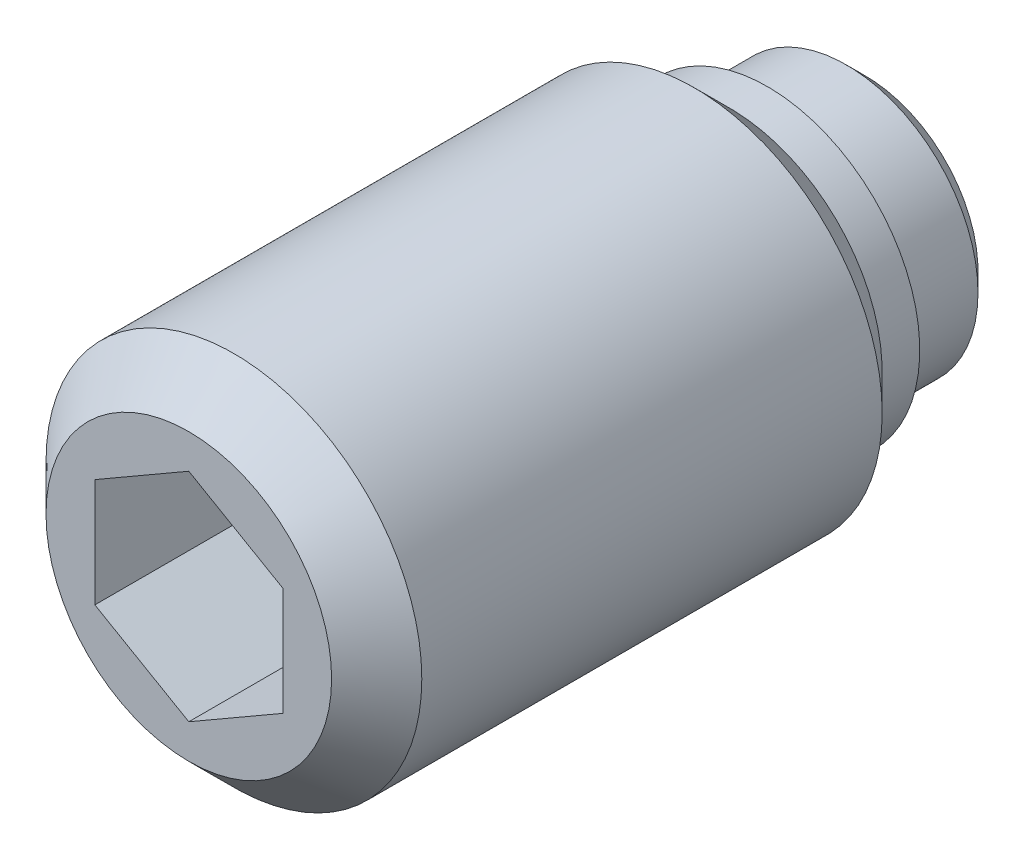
ISO-10303-21;
HEADER;
FILE_DESCRIPTION(('STEP AP214'),'2;1');
FILE_NAME('part.step','',(''),(''),'','','');
FILE_SCHEMA(('AUTOMOTIVE_DESIGN { 1 0 10303 214 1 1 1 1 }'));
ENDSEC;
DATA;
#1=APPLICATION_CONTEXT('core data for automotive mechanical design processes');
#2=APPLICATION_PROTOCOL_DEFINITION('international standard','automotive_design',2000,#1);
#3=PRODUCT_CONTEXT('',#1,'mechanical');
#4=PRODUCT('Part','Part','',(#3));
#5=PRODUCT_RELATED_PRODUCT_CATEGORY('part','',(#4));
#6=PRODUCT_DEFINITION_FORMATION('','',#4);
#7=PRODUCT_DEFINITION_CONTEXT('part definition',#1,'design');
#8=PRODUCT_DEFINITION('design','',#6,#7);
#9=PRODUCT_DEFINITION_SHAPE('','',#8);
#10=(LENGTH_UNIT() NAMED_UNIT(*) SI_UNIT(.MILLI.,.METRE.));
#11=(NAMED_UNIT(*) PLANE_ANGLE_UNIT() SI_UNIT($,.RADIAN.));
#12=(NAMED_UNIT(*) SI_UNIT($,.STERADIAN.) SOLID_ANGLE_UNIT());
#13=UNCERTAINTY_MEASURE_WITH_UNIT(LENGTH_MEASURE(1.E-05),#10,'distance_accuracy_value','');
#14=(GEOMETRIC_REPRESENTATION_CONTEXT(3) GLOBAL_UNCERTAINTY_ASSIGNED_CONTEXT((#13)) GLOBAL_UNIT_ASSIGNED_CONTEXT((#10,
#11,#12)) REPRESENTATION_CONTEXT('',''));
#15=CARTESIAN_POINT('',(0.,0.,0.));
#16=DIRECTION('',(0.,0.,1.));
#17=DIRECTION('',(1.,0.,0.));
#18=AXIS2_PLACEMENT_3D('',#15,#16,#17);
#19=CARTESIAN_POINT('',(0.,0.,2.6));
#20=DIRECTION('',(0.,0.,-1.));
#21=DIRECTION('',(-1.,0.,0.));
#22=AXIS2_PLACEMENT_3D('',#19,#20,#21);
#23=CYLINDRICAL_SURFACE('',#22,5.);
#24=CARTESIAN_POINT('',(0.,0.,4.55));
#25=DIRECTION('',(0.,0.,-1.));
#26=DIRECTION('',(-1.,0.,0.));
#27=AXIS2_PLACEMENT_3D('',#24,#25,#26);
#28=CIRCLE('',#27,5.);
#29=CARTESIAN_POINT('',(-5.,0.,4.55));
#30=VERTEX_POINT('',#29);
#31=EDGE_CURVE('E9',#30,#30,#28,.T.);
#32=ORIENTED_EDGE('',*,*,#31,.F.);
#33=EDGE_LOOP('',(#32));
#34=FACE_BOUND('',#33,.T.);
#35=CARTESIAN_POINT('',(0.,0.,16.8));
#36=DIRECTION('',(0.,0.,1.));
#37=DIRECTION('',(1.,0.,0.));
#38=AXIS2_PLACEMENT_3D('',#35,#36,#37);
#39=CIRCLE('',#38,5.);
#40=CARTESIAN_POINT('',(5.,0.,16.8));
#41=VERTEX_POINT('',#40);
#42=EDGE_CURVE('E123',#41,#41,#39,.T.);
#43=ORIENTED_EDGE('',*,*,#42,.F.);
#44=EDGE_LOOP('',(#43));
#45=FACE_BOUND('',#44,.T.);
#46=ADVANCED_FACE('F14',(#34,#45),#23,.T.);
#47=CARTESIAN_POINT('',(0.,0.,4.55));
#48=DIRECTION('',(0.,0.,1.));
#49=DIRECTION('',(1.,0.,0.));
#50=AXIS2_PLACEMENT_3D('',#47,#48,#49);
#51=CONICAL_SURFACE('',#50,5.,0.785398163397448);
#52=ORIENTED_EDGE('',*,*,#31,.T.);
#53=EDGE_LOOP('',(#52));
#54=FACE_BOUND('',#53,.T.);
#55=CARTESIAN_POINT('',(0.,0.,3.6));
#56=DIRECTION('',(0.,0.,-1.));
#57=DIRECTION('',(-1.,0.,0.));
#58=AXIS2_PLACEMENT_3D('',#55,#56,#57);
#59=CIRCLE('',#58,4.05);
#60=CARTESIAN_POINT('',(-4.05,0.,3.6));
#61=VERTEX_POINT('',#60);
#62=EDGE_CURVE('E21',#61,#61,#59,.T.);
#63=ORIENTED_EDGE('',*,*,#62,.F.);
#64=EDGE_LOOP('',(#63));
#65=FACE_BOUND('',#64,.T.);
#66=ADVANCED_FACE('F143',(#54,#65),#51,.T.);
#67=CARTESIAN_POINT('',(0.,0.,2.6));
#68=DIRECTION('',(0.,0.,-1.));
#69=DIRECTION('',(-1.,0.,0.));
#70=AXIS2_PLACEMENT_3D('',#67,#68,#69);
#71=CYLINDRICAL_SURFACE('',#70,4.05);
#72=ORIENTED_EDGE('',*,*,#62,.T.);
#73=EDGE_LOOP('',(#72));
#74=FACE_BOUND('',#73,.T.);
#75=CARTESIAN_POINT('',(0.,0.,2.6));
#76=DIRECTION('',(0.,0.,-1.));
#77=DIRECTION('',(-1.,0.,0.));
#78=AXIS2_PLACEMENT_3D('',#75,#76,#77);
#79=CIRCLE('',#78,4.05);
#80=CARTESIAN_POINT('',(-4.05,0.,2.6));
#81=VERTEX_POINT('',#80);
#82=EDGE_CURVE('E135',#81,#81,#79,.T.);
#83=ORIENTED_EDGE('',*,*,#82,.F.);
#84=EDGE_LOOP('',(#83));
#85=FACE_BOUND('',#84,.T.);
#86=ADVANCED_FACE('F140',(#74,#85),#71,.T.);
#87=CARTESIAN_POINT('',(0.,4.05,2.6));
#88=DIRECTION('',(0.,0.,1.));
#89=DIRECTION('',(1.,0.,0.));
#90=AXIS2_PLACEMENT_3D('',#87,#88,#89);
#91=PLANE('',#90);
#92=ORIENTED_EDGE('',*,*,#82,.T.);
#93=EDGE_LOOP('',(#92));
#94=FACE_BOUND('',#93,.T.);
#95=CARTESIAN_POINT('',(0.,0.,2.6));
#96=DIRECTION('',(0.,0.,-1.));
#97=DIRECTION('',(-1.,0.,0.));
#98=AXIS2_PLACEMENT_3D('',#95,#96,#97);
#99=CIRCLE('',#98,3.5);
#100=CARTESIAN_POINT('',(-3.5,0.,2.6));
#101=VERTEX_POINT('',#100);
#102=EDGE_CURVE('E132',#101,#101,#99,.T.);
#103=ORIENTED_EDGE('',*,*,#102,.F.);
#104=EDGE_LOOP('',(#103));
#105=FACE_BOUND('',#104,.T.);
#106=ADVANCED_FACE('F151',(#94,#105),#91,.F.);
#107=CARTESIAN_POINT('',(0.,0.,0.));
#108=DIRECTION('',(0.,0.,-1.));
#109=DIRECTION('',(-1.,0.,0.));
#110=AXIS2_PLACEMENT_3D('',#107,#108,#109);
#111=CYLINDRICAL_SURFACE('',#110,3.5);
#112=CARTESIAN_POINT('',(0.,0.,0.5));
#113=DIRECTION('',(0.,0.,-1.));
#114=DIRECTION('',(-1.,0.,0.));
#115=AXIS2_PLACEMENT_3D('',#112,#113,#114);
#116=CIRCLE('',#115,3.5);
#117=CARTESIAN_POINT('',(-3.5,0.,0.5));
#118=VERTEX_POINT('',#117);
#119=EDGE_CURVE('E129',#118,#118,#116,.T.);
#120=ORIENTED_EDGE('',*,*,#119,.F.);
#121=EDGE_LOOP('',(#120));
#122=FACE_BOUND('',#121,.T.);
#123=ORIENTED_EDGE('',*,*,#102,.T.);
#124=EDGE_LOOP('',(#123));
#125=FACE_BOUND('',#124,.T.);
#126=ADVANCED_FACE('F157',(#122,#125),#111,.T.);
#127=CARTESIAN_POINT('',(0.,0.,0.5));
#128=DIRECTION('',(0.,0.,1.));
#129=DIRECTION('',(1.,0.,0.));
#130=AXIS2_PLACEMENT_3D('',#127,#128,#129);
#131=CONICAL_SURFACE('',#130,3.5,0.785398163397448);
#132=CARTESIAN_POINT('',(0.,0.,0.));
#133=DIRECTION('',(0.,0.,-1.));
#134=DIRECTION('',(-1.,0.,0.));
#135=AXIS2_PLACEMENT_3D('',#132,#133,#134);
#136=CIRCLE('',#135,3.);
#137=CARTESIAN_POINT('',(-3.,0.,0.));
#138=VERTEX_POINT('',#137);
#139=EDGE_CURVE('E126',#138,#138,#136,.T.);
#140=ORIENTED_EDGE('',*,*,#139,.F.);
#141=EDGE_LOOP('',(#140));
#142=FACE_BOUND('',#141,.T.);
#143=ORIENTED_EDGE('',*,*,#119,.T.);
#144=EDGE_LOOP('',(#143));
#145=FACE_BOUND('',#144,.T.);
#146=ADVANCED_FACE('F161',(#142,#145),#131,.T.);
#147=CARTESIAN_POINT('',(0.,3.,0.));
#148=DIRECTION('',(0.,0.,1.));
#149=DIRECTION('',(1.,0.,0.));
#150=AXIS2_PLACEMENT_3D('',#147,#148,#149);
#151=PLANE('',#150);
#152=ORIENTED_EDGE('',*,*,#139,.T.);
#153=EDGE_LOOP('',(#152));
#154=FACE_BOUND('',#153,.T.);
#155=ADVANCED_FACE('F165',(#154),#151,.F.);
#156=CARTESIAN_POINT('',(0.,0.,18.));
#157=DIRECTION('',(0.,0.,-1.));
#158=DIRECTION('',(-1.,0.,0.));
#159=AXIS2_PLACEMENT_3D('',#156,#157,#158);
#160=CONICAL_SURFACE('',#159,3.8,0.785398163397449);
#161=ORIENTED_EDGE('',*,*,#42,.T.);
#162=EDGE_LOOP('',(#161));
#163=FACE_BOUND('',#162,.T.);
#164=CARTESIAN_POINT('',(0.,0.,18.));
#165=DIRECTION('',(0.,0.,1.));
#166=DIRECTION('',(1.,0.,0.));
#167=AXIS2_PLACEMENT_3D('',#164,#165,#166);
#168=CIRCLE('',#167,3.8);
#169=CARTESIAN_POINT('',(3.8,0.,18.));
#170=VERTEX_POINT('',#169);
#171=EDGE_CURVE('E115',#170,#170,#168,.T.);
#172=ORIENTED_EDGE('',*,*,#171,.F.);
#173=EDGE_LOOP('',(#172));
#174=FACE_BOUND('',#173,.T.);
#175=ADVANCED_FACE('F169',(#163,#174),#160,.T.);
#176=CARTESIAN_POINT('',(0.,-3.8,18.));
#177=DIRECTION('',(0.,0.,1.));
#178=DIRECTION('',(1.,0.,0.));
#179=AXIS2_PLACEMENT_3D('',#176,#177,#178);
#180=PLANE('',#179);
#181=DIRECTION('',(0.866025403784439,-0.5,0.));
#182=VECTOR('',#181,1.);
#183=CARTESIAN_POINT('',(-2.5,-1.44337567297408,18.));
#184=LINE('',#183,#182);
#185=CARTESIAN_POINT('',(-2.5,-1.44337567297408,18.));
#186=VERTEX_POINT('',#185);
#187=CARTESIAN_POINT('',(0.,-2.88675134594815,18.));
#188=VERTEX_POINT('',#187);
#189=EDGE_CURVE('E28',#186,#188,#184,.T.);
#190=ORIENTED_EDGE('',*,*,#189,.F.);
#191=DIRECTION('',(0.,-1.,0.));
#192=VECTOR('',#191,1.);
#193=CARTESIAN_POINT('',(-2.5,1.44337567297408,18.));
#194=LINE('',#193,#192);
#195=CARTESIAN_POINT('',(-2.5,1.44337567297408,18.));
#196=VERTEX_POINT('',#195);
#197=EDGE_CURVE('E111',#196,#186,#194,.T.);
#198=ORIENTED_EDGE('',*,*,#197,.F.);
#199=DIRECTION('',(-0.866025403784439,-0.5,0.));
#200=VECTOR('',#199,1.);
#201=CARTESIAN_POINT('',(0.,2.88675134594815,18.));
#202=LINE('',#201,#200);
#203=CARTESIAN_POINT('',(0.,2.88675134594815,18.));
#204=VERTEX_POINT('',#203);
#205=EDGE_CURVE('E109',#204,#196,#202,.T.);
#206=ORIENTED_EDGE('',*,*,#205,.F.);
#207=DIRECTION('',(-0.866025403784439,0.5,0.));
#208=VECTOR('',#207,1.);
#209=CARTESIAN_POINT('',(2.5,1.44337567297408,18.));
#210=LINE('',#209,#208);
#211=CARTESIAN_POINT('',(2.5,1.44337567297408,18.));
#212=VERTEX_POINT('',#211);
#213=EDGE_CURVE('E76',#212,#204,#210,.T.);
#214=ORIENTED_EDGE('',*,*,#213,.F.);
#215=DIRECTION('',(0.,1.,0.));
#216=VECTOR('',#215,1.);
#217=CARTESIAN_POINT('',(2.5,-1.44337567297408,18.));
#218=LINE('',#217,#216);
#219=CARTESIAN_POINT('',(2.5,-1.44337567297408,18.));
#220=VERTEX_POINT('',#219);
#221=EDGE_CURVE('E105',#220,#212,#218,.T.);
#222=ORIENTED_EDGE('',*,*,#221,.F.);
#223=DIRECTION('',(0.866025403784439,0.5,0.));
#224=VECTOR('',#223,1.);
#225=CARTESIAN_POINT('',(0.,-2.88675134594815,18.));
#226=LINE('',#225,#224);
#227=EDGE_CURVE('E102',#188,#220,#226,.T.);
#228=ORIENTED_EDGE('',*,*,#227,.F.);
#229=EDGE_LOOP('',(#190,#198,#206,#214,#222,#228));
#230=FACE_BOUND('',#229,.T.);
#231=ORIENTED_EDGE('',*,*,#171,.T.);
#232=EDGE_LOOP('',(#231));
#233=FACE_BOUND('',#232,.T.);
#234=ADVANCED_FACE('F173',(#230,#233),#180,.T.);
#235=CARTESIAN_POINT('',(-2.5,-1.44337567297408,12.));
#236=DIRECTION('',(-0.5,-0.866025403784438,0.));
#237=DIRECTION('',(0.866025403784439,-0.5,0.));
#238=AXIS2_PLACEMENT_3D('',#235,#236,#237);
#239=PLANE('',#238);
#240=ORIENTED_EDGE('',*,*,#189,.T.);
#241=DIRECTION('',(0.,0.,1.));
#242=VECTOR('',#241,1.);
#243=CARTESIAN_POINT('',(0.,-2.88675134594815,12.));
#244=LINE('',#243,#242);
#245=CARTESIAN_POINT('',(0.,-2.88675134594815,12.));
#246=VERTEX_POINT('',#245);
#247=EDGE_CURVE('E58',#246,#188,#244,.T.);
#248=ORIENTED_EDGE('',*,*,#247,.F.);
#249=DIRECTION('',(0.866025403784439,-0.5,0.));
#250=VECTOR('',#249,1.);
#251=CARTESIAN_POINT('',(-2.5,-1.44337567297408,12.));
#252=LINE('',#251,#250);
#253=CARTESIAN_POINT('',(-2.5,-1.44337567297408,12.));
#254=VERTEX_POINT('',#253);
#255=EDGE_CURVE('E113',#254,#246,#252,.T.);
#256=ORIENTED_EDGE('',*,*,#255,.F.);
#257=DIRECTION('',(0.,0.,1.));
#258=VECTOR('',#257,1.);
#259=CARTESIAN_POINT('',(-2.5,-1.44337567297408,12.));
#260=LINE('',#259,#258);
#261=EDGE_CURVE('E36',#254,#186,#260,.T.);
#262=ORIENTED_EDGE('',*,*,#261,.T.);
#263=EDGE_LOOP('',(#240,#248,#256,#262));
#264=FACE_BOUND('',#263,.T.);
#265=ADVANCED_FACE('F177',(#264),#239,.F.);
#266=CARTESIAN_POINT('',(-2.5,1.44337567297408,12.));
#267=DIRECTION('',(-1.,0.,0.));
#268=DIRECTION('',(0.,0.,1.));
#269=AXIS2_PLACEMENT_3D('',#266,#267,#268);
#270=PLANE('',#269);
#271=ORIENTED_EDGE('',*,*,#197,.T.);
#272=ORIENTED_EDGE('',*,*,#261,.F.);
#273=DIRECTION('',(0.,-1.,0.));
#274=VECTOR('',#273,1.);
#275=CARTESIAN_POINT('',(-2.5,1.44337567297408,12.));
#276=LINE('',#275,#274);
#277=CARTESIAN_POINT('',(-2.5,1.44337567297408,12.));
#278=VERTEX_POINT('',#277);
#279=EDGE_CURVE('E88',#278,#254,#276,.T.);
#280=ORIENTED_EDGE('',*,*,#279,.F.);
#281=DIRECTION('',(0.,0.,1.));
#282=VECTOR('',#281,1.);
#283=CARTESIAN_POINT('',(-2.5,1.44337567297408,12.));
#284=LINE('',#283,#282);
#285=EDGE_CURVE('E80',#278,#196,#284,.T.);
#286=ORIENTED_EDGE('',*,*,#285,.T.);
#287=EDGE_LOOP('',(#271,#272,#280,#286));
#288=FACE_BOUND('',#287,.T.);
#289=ADVANCED_FACE('F181',(#288),#270,.F.);
#290=CARTESIAN_POINT('',(0.,2.88675134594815,12.));
#291=DIRECTION('',(-0.5,0.866025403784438,0.));
#292=DIRECTION('',(-0.866025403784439,-0.5,0.));
#293=AXIS2_PLACEMENT_3D('',#290,#291,#292);
#294=PLANE('',#293);
#295=ORIENTED_EDGE('',*,*,#205,.T.);
#296=ORIENTED_EDGE('',*,*,#285,.F.);
#297=DIRECTION('',(-0.866025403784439,-0.5,0.));
#298=VECTOR('',#297,1.);
#299=CARTESIAN_POINT('',(0.,2.88675134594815,12.));
#300=LINE('',#299,#298);
#301=CARTESIAN_POINT('',(0.,2.88675134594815,12.));
#302=VERTEX_POINT('',#301);
#303=EDGE_CURVE('E84',#302,#278,#300,.T.);
#304=ORIENTED_EDGE('',*,*,#303,.F.);
#305=DIRECTION('',(0.,0.,1.));
#306=VECTOR('',#305,1.);
#307=CARTESIAN_POINT('',(0.,2.88675134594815,12.));
#308=LINE('',#307,#306);
#309=EDGE_CURVE('E69',#302,#204,#308,.T.);
#310=ORIENTED_EDGE('',*,*,#309,.T.);
#311=EDGE_LOOP('',(#295,#296,#304,#310));
#312=FACE_BOUND('',#311,.T.);
#313=ADVANCED_FACE('F85',(#312),#294,.F.);
#314=CARTESIAN_POINT('',(2.5,1.44337567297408,12.));
#315=DIRECTION('',(0.5,0.866025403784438,0.));
#316=DIRECTION('',(-0.866025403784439,0.5,0.));
#317=AXIS2_PLACEMENT_3D('',#314,#315,#316);
#318=PLANE('',#317);
#319=ORIENTED_EDGE('',*,*,#213,.T.);
#320=ORIENTED_EDGE('',*,*,#309,.F.);
#321=DIRECTION('',(-0.866025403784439,0.5,0.));
#322=VECTOR('',#321,1.);
#323=CARTESIAN_POINT('',(2.5,1.44337567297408,12.));
#324=LINE('',#323,#322);
#325=CARTESIAN_POINT('',(2.5,1.44337567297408,12.));
#326=VERTEX_POINT('',#325);
#327=EDGE_CURVE('E73',#326,#302,#324,.T.);
#328=ORIENTED_EDGE('',*,*,#327,.F.);
#329=DIRECTION('',(0.,0.,1.));
#330=VECTOR('',#329,1.);
#331=CARTESIAN_POINT('',(2.5,1.44337567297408,12.));
#332=LINE('',#331,#330);
#333=EDGE_CURVE('E81',#326,#212,#332,.T.);
#334=ORIENTED_EDGE('',*,*,#333,.T.);
#335=EDGE_LOOP('',(#319,#320,#328,#334));
#336=FACE_BOUND('',#335,.T.);
#337=ADVANCED_FACE('F71',(#336),#318,.F.);
#338=CARTESIAN_POINT('',(2.5,-1.44337567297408,12.));
#339=DIRECTION('',(1.,0.,0.));
#340=DIRECTION('',(0.,0.,-1.));
#341=AXIS2_PLACEMENT_3D('',#338,#339,#340);
#342=PLANE('',#341);
#343=ORIENTED_EDGE('',*,*,#221,.T.);
#344=ORIENTED_EDGE('',*,*,#333,.F.);
#345=DIRECTION('',(0.,1.,0.));
#346=VECTOR('',#345,1.);
#347=CARTESIAN_POINT('',(2.5,-1.44337567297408,12.));
#348=LINE('',#347,#346);
#349=CARTESIAN_POINT('',(2.5,-1.44337567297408,12.));
#350=VERTEX_POINT('',#349);
#351=EDGE_CURVE('E94',#350,#326,#348,.T.);
#352=ORIENTED_EDGE('',*,*,#351,.F.);
#353=DIRECTION('',(0.,0.,1.));
#354=VECTOR('',#353,1.);
#355=CARTESIAN_POINT('',(2.5,-1.44337567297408,12.));
#356=LINE('',#355,#354);
#357=EDGE_CURVE('E118',#350,#220,#356,.T.);
#358=ORIENTED_EDGE('',*,*,#357,.T.);
#359=EDGE_LOOP('',(#343,#344,#352,#358));
#360=FACE_BOUND('',#359,.T.);
#361=ADVANCED_FACE('F185',(#360),#342,.F.);
#362=CARTESIAN_POINT('',(0.,-2.88675134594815,12.));
#363=DIRECTION('',(0.5,-0.866025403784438,0.));
#364=DIRECTION('',(0.866025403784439,0.5,0.));
#365=AXIS2_PLACEMENT_3D('',#362,#363,#364);
#366=PLANE('',#365);
#367=ORIENTED_EDGE('',*,*,#227,.T.);
#368=ORIENTED_EDGE('',*,*,#357,.F.);
#369=DIRECTION('',(0.866025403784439,0.5,0.));
#370=VECTOR('',#369,1.);
#371=CARTESIAN_POINT('',(0.,-2.88675134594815,12.));
#372=LINE('',#371,#370);
#373=EDGE_CURVE('E96',#246,#350,#372,.T.);
#374=ORIENTED_EDGE('',*,*,#373,.F.);
#375=ORIENTED_EDGE('',*,*,#247,.T.);
#376=EDGE_LOOP('',(#367,#368,#374,#375));
#377=FACE_BOUND('',#376,.T.);
#378=ADVANCED_FACE('F182',(#377),#366,.F.);
#379=CARTESIAN_POINT('',(0.,0.,12.));
#380=DIRECTION('',(0.,0.,1.));
#381=DIRECTION('',(1.,0.,0.));
#382=AXIS2_PLACEMENT_3D('',#379,#380,#381);
#383=PLANE('',#382);
#384=ORIENTED_EDGE('',*,*,#255,.T.);
#385=ORIENTED_EDGE('',*,*,#373,.T.);
#386=ORIENTED_EDGE('',*,*,#351,.T.);
#387=ORIENTED_EDGE('',*,*,#327,.T.);
#388=ORIENTED_EDGE('',*,*,#303,.T.);
#389=ORIENTED_EDGE('',*,*,#279,.T.);
#390=EDGE_LOOP('',(#384,#385,#386,#387,#388,#389));
#391=FACE_BOUND('',#390,.T.);
#392=ADVANCED_FACE('F91',(#391),#383,.T.);
#393=CLOSED_SHELL('',(#46,#66,#86,#106,#126,#146,#155,#175,#234,#265,#289,#313,#337,#361,#378,#392));
#394=MANIFOLD_SOLID_BREP('B1',#393);
#395=ADVANCED_BREP_SHAPE_REPRESENTATION('',(#18,#394),#14);
#396=SHAPE_DEFINITION_REPRESENTATION(#9,#395);
ENDSEC;
END-ISO-10303-21;
